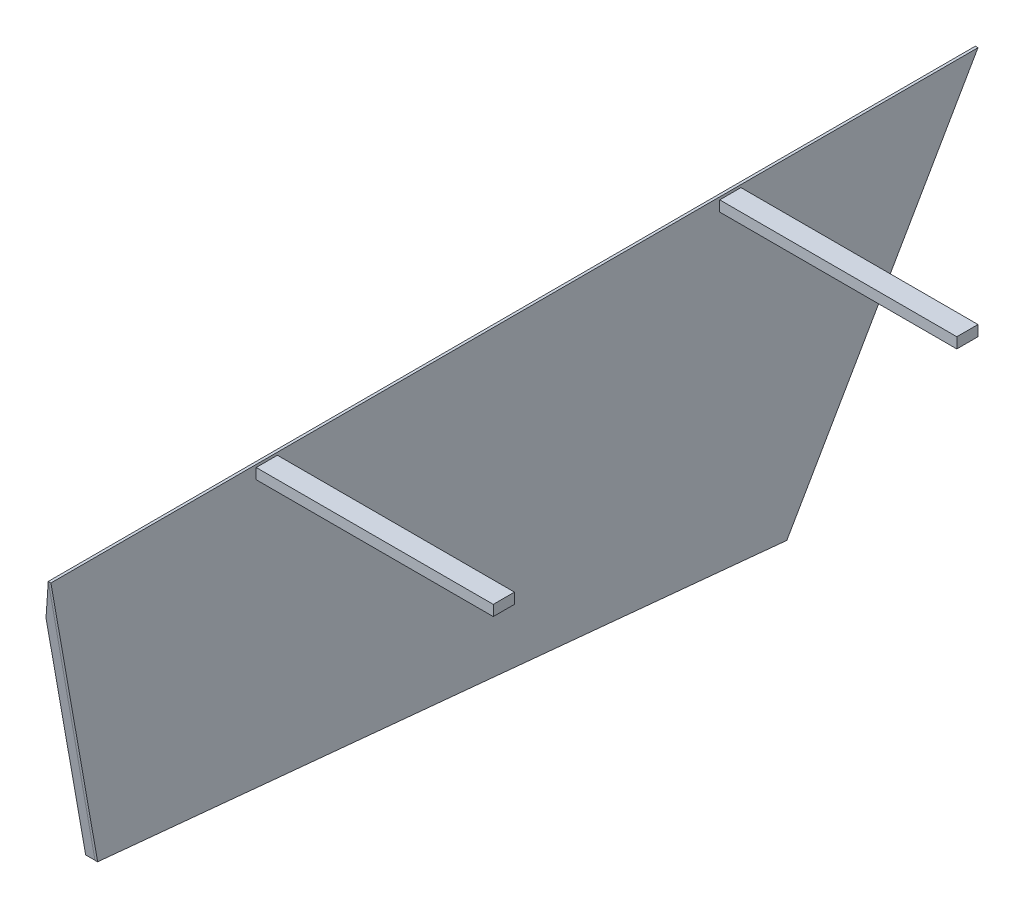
ISO-10303-21;
HEADER;
FILE_DESCRIPTION(('STEP AP214'),'2;1');
FILE_NAME('part.step','',(''),(''),'','','');
FILE_SCHEMA(('AUTOMOTIVE_DESIGN { 1 0 10303 214 1 1 1 1 }'));
ENDSEC;
DATA;
#1=APPLICATION_CONTEXT('core data for automotive mechanical design processes');
#2=APPLICATION_PROTOCOL_DEFINITION('international standard','automotive_design',2000,#1);
#3=PRODUCT_CONTEXT('',#1,'mechanical');
#4=PRODUCT('Part','Part','',(#3));
#5=PRODUCT_RELATED_PRODUCT_CATEGORY('part','',(#4));
#6=PRODUCT_DEFINITION_FORMATION('','',#4);
#7=PRODUCT_DEFINITION_CONTEXT('part definition',#1,'design');
#8=PRODUCT_DEFINITION('design','',#6,#7);
#9=PRODUCT_DEFINITION_SHAPE('','',#8);
#10=(LENGTH_UNIT() NAMED_UNIT(*) SI_UNIT(.MILLI.,.METRE.));
#11=(NAMED_UNIT(*) PLANE_ANGLE_UNIT() SI_UNIT($,.RADIAN.));
#12=(NAMED_UNIT(*) SI_UNIT($,.STERADIAN.) SOLID_ANGLE_UNIT());
#13=UNCERTAINTY_MEASURE_WITH_UNIT(LENGTH_MEASURE(1.E-05),#10,'distance_accuracy_value','');
#14=(GEOMETRIC_REPRESENTATION_CONTEXT(3) GLOBAL_UNCERTAINTY_ASSIGNED_CONTEXT((#13)) GLOBAL_UNIT_ASSIGNED_CONTEXT((#10,
#11,#12)) REPRESENTATION_CONTEXT('',''));
#15=CARTESIAN_POINT('',(0.,0.,0.));
#16=DIRECTION('',(0.,0.,1.));
#17=DIRECTION('',(1.,0.,0.));
#18=AXIS2_PLACEMENT_3D('',#15,#16,#17);
#19=CARTESIAN_POINT('',(-40.,-764.88660493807,1774.39655010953));
#20=DIRECTION('',(0.,-0.173648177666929,0.984807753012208));
#21=DIRECTION('',(0.,-0.984807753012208,-0.173648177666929));
#22=AXIS2_PLACEMENT_3D('',#19,#20,#21);
#23=PLANE('',#22);
#24=DIRECTION('',(0.,-0.984807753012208,-0.173648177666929));
#25=VECTOR('',#24,1.);
#26=CARTESIAN_POINT('',(-40.,-764.88660493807,1774.39655010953));
#27=LINE('',#26,#25);
#28=CARTESIAN_POINT('',(-40.,100.000000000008,1926.89939381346));
#29=VERTEX_POINT('',#28);
#30=CARTESIAN_POINT('',(-40.,-764.88660493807,1774.39655010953));
#31=VERTEX_POINT('',#30);
#32=EDGE_CURVE('E101',#29,#31,#27,.T.);
#33=ORIENTED_EDGE('',*,*,#32,.F.);
#34=DIRECTION('',(-0.223951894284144,-0.959793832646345,-0.169237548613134));
#35=VECTOR('',#34,1.);
#36=CARTESIAN_POINT('',(-113.031548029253,-212.992348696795,1871.7103979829));
#37=LINE('',#36,#35);
#38=CARTESIAN_POINT('',(-5.,250.00000000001,1953.34844091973));
#39=VERTEX_POINT('',#38);
#40=EDGE_CURVE('E62',#29,#39,#37,.F.);
#41=ORIENTED_EDGE('',*,*,#40,.T.);
#42=DIRECTION('',(0.,-0.984807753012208,-0.173648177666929));
#43=VECTOR('',#42,1.);
#44=CARTESIAN_POINT('',(-5.,-764.88660493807,1774.39655010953));
#45=LINE('',#44,#43);
#46=CARTESIAN_POINT('',(-5.,-764.88660493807,1774.39655010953));
#47=VERTEX_POINT('',#46);
#48=EDGE_CURVE('E106',#39,#47,#45,.T.);
#49=ORIENTED_EDGE('',*,*,#48,.T.);
#50=DIRECTION('',(1.,0.,0.));
#51=VECTOR('',#50,1.);
#52=CARTESIAN_POINT('',(-40.,-764.88660493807,1774.39655010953));
#53=LINE('',#52,#51);
#54=EDGE_CURVE('E121',#31,#47,#53,.T.);
#55=ORIENTED_EDGE('',*,*,#54,.F.);
#56=EDGE_LOOP('',(#33,#41,#49,#55));
#57=FACE_BOUND('',#56,.T.);
#58=ADVANCED_FACE('F53',(#57),#23,.F.);
#59=CARTESIAN_POINT('',(-40.,-749.99999999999,1929.33545199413));
#60=DIRECTION('',(0.,0.995415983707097,-0.0956400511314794));
#61=DIRECTION('',(0.,0.0956400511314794,0.995415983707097));
#62=AXIS2_PLACEMENT_3D('',#59,#60,#61);
#63=PLANE('',#62);
#64=DIRECTION('',(0.,0.0956400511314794,0.995415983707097));
#65=VECTOR('',#64,1.);
#66=CARTESIAN_POINT('',(-5.,-749.99999999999,1929.33545199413));
#67=LINE('',#66,#65);
#68=CARTESIAN_POINT('',(-5.,-749.99999999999,1929.33545199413));
#69=VERTEX_POINT('',#68);
#70=EDGE_CURVE('E100',#47,#69,#67,.T.);
#71=ORIENTED_EDGE('',*,*,#70,.T.);
#72=DIRECTION('',(1.,0.,0.));
#73=VECTOR('',#72,1.);
#74=CARTESIAN_POINT('',(-40.,-749.99999999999,1929.33545199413));
#75=LINE('',#74,#73);
#76=CARTESIAN_POINT('',(-40.,-749.99999999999,1929.33545199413));
#77=VERTEX_POINT('',#76);
#78=EDGE_CURVE('E97',#77,#69,#75,.T.);
#79=ORIENTED_EDGE('',*,*,#78,.F.);
#80=DIRECTION('',(0.,0.0956400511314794,0.995415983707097));
#81=VECTOR('',#80,1.);
#82=CARTESIAN_POINT('',(-40.,-749.99999999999,1929.33545199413));
#83=LINE('',#82,#81);
#84=EDGE_CURVE('E114',#31,#77,#83,.T.);
#85=ORIENTED_EDGE('',*,*,#84,.F.);
#86=ORIENTED_EDGE('',*,*,#54,.T.);
#87=EDGE_LOOP('',(#71,#79,#85,#86));
#88=FACE_BOUND('',#87,.T.);
#89=ADVANCED_FACE('F126',(#88),#63,.F.);
#90=CARTESIAN_POINT('',(-40.,250.00000000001,2105.66243270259));
#91=DIRECTION('',(0.,0.17364817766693,-0.984807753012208));
#92=DIRECTION('',(0.,0.984807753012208,0.17364817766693));
#93=AXIS2_PLACEMENT_3D('',#90,#91,#92);
#94=PLANE('',#93);
#95=DIRECTION('',(0.,0.984807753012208,0.17364817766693));
#96=VECTOR('',#95,1.);
#97=CARTESIAN_POINT('',(-5.,250.00000000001,2105.66243270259));
#98=LINE('',#97,#96);
#99=CARTESIAN_POINT('',(-5.,250.00000000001,2105.66243270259));
#100=VERTEX_POINT('',#99);
#101=EDGE_CURVE('E93',#69,#100,#98,.T.);
#102=ORIENTED_EDGE('',*,*,#101,.T.);
#103=DIRECTION('',(0.223951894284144,0.959793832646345,0.169237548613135));
#104=VECTOR('',#103,1.);
#105=CARTESIAN_POINT('',(-118.804411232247,-237.733190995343,2019.66191174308));
#106=LINE('',#105,#104);
#107=CARTESIAN_POINT('',(-40.,100.000000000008,2079.21338559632));
#108=VERTEX_POINT('',#107);
#109=EDGE_CURVE('E12',#100,#108,#106,.F.);
#110=ORIENTED_EDGE('',*,*,#109,.T.);
#111=DIRECTION('',(0.,0.984807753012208,0.17364817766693));
#112=VECTOR('',#111,1.);
#113=CARTESIAN_POINT('',(-40.,250.00000000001,2105.66243270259));
#114=LINE('',#113,#112);
#115=EDGE_CURVE('E116',#77,#108,#114,.T.);
#116=ORIENTED_EDGE('',*,*,#115,.F.);
#117=ORIENTED_EDGE('',*,*,#78,.T.);
#118=EDGE_LOOP('',(#102,#110,#116,#117));
#119=FACE_BOUND('',#118,.T.);
#120=ADVANCED_FACE('F95',(#119),#94,.F.);
#121=CARTESIAN_POINT('',(-40.,0.,0.));
#122=DIRECTION('',(1.,0.,0.));
#123=DIRECTION('',(0.,0.,-1.));
#124=AXIS2_PLACEMENT_3D('',#121,#122,#123);
#125=PLANE('',#124);
#126=ORIENTED_EDGE('',*,*,#115,.T.);
#127=DIRECTION('',(0.,0.,-1.));
#128=VECTOR('',#127,1.);
#129=CARTESIAN_POINT('',(-40.,100.000000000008,0.));
#130=LINE('',#129,#128);
#131=EDGE_CURVE('E107',#108,#29,#130,.T.);
#132=ORIENTED_EDGE('',*,*,#131,.T.);
#133=ORIENTED_EDGE('',*,*,#32,.T.);
#134=ORIENTED_EDGE('',*,*,#84,.T.);
#135=EDGE_LOOP('',(#126,#132,#133,#134));
#136=FACE_BOUND('',#135,.T.);
#137=ADVANCED_FACE('F128',(#136),#125,.F.);
#138=CARTESIAN_POINT('',(-5.,0.,0.));
#139=DIRECTION('',(1.,0.,0.));
#140=DIRECTION('',(0.,0.,-1.));
#141=AXIS2_PLACEMENT_3D('',#138,#139,#140);
#142=PLANE('',#141);
#143=DIRECTION('',(0.,0.,-1.));
#144=VECTOR('',#143,1.);
#145=CARTESIAN_POINT('',(-5.,250.00000000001,1953.34844091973));
#146=LINE('',#145,#144);
#147=EDGE_CURVE('E104',#100,#39,#146,.T.);
#148=ORIENTED_EDGE('',*,*,#147,.F.);
#149=ORIENTED_EDGE('',*,*,#101,.F.);
#150=ORIENTED_EDGE('',*,*,#70,.F.);
#151=ORIENTED_EDGE('',*,*,#48,.F.);
#152=EDGE_LOOP('',(#148,#149,#150,#151));
#153=FACE_BOUND('',#152,.T.);
#154=ADVANCED_FACE('F105',(#153),#142,.T.);
#155=CARTESIAN_POINT('',(-40.,100.000000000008,0.));
#156=DIRECTION('',(0.973841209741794,-0.227229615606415,0.));
#157=DIRECTION('',(0.,0.,-1.));
#158=AXIS2_PLACEMENT_3D('',#155,#156,#157);
#159=PLANE('',#158);
#160=ORIENTED_EDGE('',*,*,#109,.F.);
#161=ORIENTED_EDGE('',*,*,#147,.T.);
#162=ORIENTED_EDGE('',*,*,#40,.F.);
#163=ORIENTED_EDGE('',*,*,#131,.F.);
#164=EDGE_LOOP('',(#160,#161,#162,#163));
#165=FACE_BOUND('',#164,.T.);
#166=ADVANCED_FACE('F56',(#165),#159,.F.);
#167=CLOSED_SHELL('',(#58,#89,#120,#137,#154,#166));
#168=MANIFOLD_SOLID_BREP('B2',#167);
#169=CARTESIAN_POINT('',(-40.,250.00000000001,-1394.33756729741));
#170=DIRECTION('',(0.,0.500000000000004,0.866025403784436));
#171=DIRECTION('',(0.,-0.866025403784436,0.500000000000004));
#172=AXIS2_PLACEMENT_3D('',#169,#170,#171);
#173=PLANE('',#172);
#174=DIRECTION('',(0.,-0.866025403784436,0.500000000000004));
#175=VECTOR('',#174,1.);
#176=CARTESIAN_POINT('',(-40.,250.00000000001,-1394.33756729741));
#177=LINE('',#176,#175);
#178=CARTESIAN_POINT('',(-40.,100.000000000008,-1307.73502691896));
#179=VERTEX_POINT('',#178);
#180=CARTESIAN_POINT('',(-40.,-999.99999999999,-672.649730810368));
#181=VERTEX_POINT('',#180);
#182=EDGE_CURVE('E240',#179,#181,#177,.T.);
#183=ORIENTED_EDGE('',*,*,#182,.F.);
#184=DIRECTION('',(0.198069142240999,0.848867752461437,-0.490094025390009));
#185=VECTOR('',#184,1.);
#186=CARTESIAN_POINT('',(-166.945112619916,-444.050482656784,-993.627334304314));
#187=LINE('',#186,#185);
#188=CARTESIAN_POINT('',(-5.,250.00000000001,-1394.33756729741));
#189=VERTEX_POINT('',#188);
#190=EDGE_CURVE('E209',#179,#189,#187,.T.);
#191=ORIENTED_EDGE('',*,*,#190,.T.);
#192=DIRECTION('',(0.,-0.866025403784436,0.500000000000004));
#193=VECTOR('',#192,1.);
#194=CARTESIAN_POINT('',(-5.,250.00000000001,-1394.33756729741));
#195=LINE('',#194,#193);
#196=CARTESIAN_POINT('',(-5.,-999.99999999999,-672.649730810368));
#197=VERTEX_POINT('',#196);
#198=EDGE_CURVE('E253',#189,#197,#195,.T.);
#199=ORIENTED_EDGE('',*,*,#198,.T.);
#200=DIRECTION('',(1.,0.,0.));
#201=VECTOR('',#200,1.);
#202=CARTESIAN_POINT('',(-40.,-999.99999999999,-672.649730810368));
#203=LINE('',#202,#201);
#204=EDGE_CURVE('E251',#181,#197,#203,.T.);
#205=ORIENTED_EDGE('',*,*,#204,.F.);
#206=EDGE_LOOP('',(#183,#191,#199,#205));
#207=FACE_BOUND('',#206,.T.);
#208=ADVANCED_FACE('F200',(#207),#173,.F.);
#209=CARTESIAN_POINT('',(-40.,-999.99999999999,-672.649730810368));
#210=DIRECTION('',(0.,0.995415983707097,-0.0956400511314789));
#211=DIRECTION('',(0.,0.0956400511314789,0.995415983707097));
#212=AXIS2_PLACEMENT_3D('',#209,#210,#211);
#213=PLANE('',#212);
#214=DIRECTION('',(0.,0.0956400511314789,0.995415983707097));
#215=VECTOR('',#214,1.);
#216=CARTESIAN_POINT('',(-5.,-999.99999999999,-672.649730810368));
#217=LINE('',#216,#215);
#218=CARTESIAN_POINT('',(-5.,-984.233000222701,-508.547731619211));
#219=VERTEX_POINT('',#218);
#220=EDGE_CURVE('E267',#197,#219,#217,.T.);
#221=ORIENTED_EDGE('',*,*,#220,.T.);
#222=DIRECTION('',(1.,0.,0.));
#223=VECTOR('',#222,1.);
#224=CARTESIAN_POINT('',(-40.,-984.233000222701,-508.547731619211));
#225=LINE('',#224,#223);
#226=CARTESIAN_POINT('',(-40.,-984.233000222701,-508.547731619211));
#227=VERTEX_POINT('',#226);
#228=EDGE_CURVE('E256',#227,#219,#225,.T.);
#229=ORIENTED_EDGE('',*,*,#228,.F.);
#230=DIRECTION('',(0.,0.0956400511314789,0.995415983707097));
#231=VECTOR('',#230,1.);
#232=CARTESIAN_POINT('',(-40.,-999.99999999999,-672.649730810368));
#233=LINE('',#232,#231);
#234=EDGE_CURVE('E244',#181,#227,#233,.T.);
#235=ORIENTED_EDGE('',*,*,#234,.F.);
#236=ORIENTED_EDGE('',*,*,#204,.T.);
#237=EDGE_LOOP('',(#221,#229,#235,#236));
#238=FACE_BOUND('',#237,.T.);
#239=ADVANCED_FACE('F258',(#238),#213,.F.);
#240=CARTESIAN_POINT('',(-40.,-984.233000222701,-508.547731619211));
#241=DIRECTION('',(0.,-0.500000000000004,-0.866025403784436));
#242=DIRECTION('',(0.,0.866025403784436,-0.500000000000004));
#243=AXIS2_PLACEMENT_3D('',#240,#241,#242);
#244=PLANE('',#243);
#245=DIRECTION('',(0.,0.866025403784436,-0.500000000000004));
#246=VECTOR('',#245,1.);
#247=CARTESIAN_POINT('',(-5.,-984.233000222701,-508.547731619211));
#248=LINE('',#247,#246);
#249=CARTESIAN_POINT('',(-5.,250.00000000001,-1221.13248654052));
#250=VERTEX_POINT('',#249);
#251=EDGE_CURVE('E248',#219,#250,#248,.T.);
#252=ORIENTED_EDGE('',*,*,#251,.T.);
#253=DIRECTION('',(-0.198069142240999,-0.848867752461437,0.490094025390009));
#254=VECTOR('',#253,1.);
#255=CARTESIAN_POINT('',(-150.131661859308,-371.99283653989,-862.024754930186));
#256=LINE('',#255,#254);
#257=CARTESIAN_POINT('',(-40.,100.000000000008,-1134.52994616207));
#258=VERTEX_POINT('',#257);
#259=EDGE_CURVE('E51',#250,#258,#256,.T.);
#260=ORIENTED_EDGE('',*,*,#259,.T.);
#261=DIRECTION('',(0.,0.866025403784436,-0.500000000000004));
#262=VECTOR('',#261,1.);
#263=CARTESIAN_POINT('',(-40.,-984.233000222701,-508.547731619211));
#264=LINE('',#263,#262);
#265=EDGE_CURVE('E260',#227,#258,#264,.T.);
#266=ORIENTED_EDGE('',*,*,#265,.F.);
#267=ORIENTED_EDGE('',*,*,#228,.T.);
#268=EDGE_LOOP('',(#252,#260,#266,#267));
#269=FACE_BOUND('',#268,.T.);
#270=ADVANCED_FACE('F284',(#269),#244,.F.);
#271=CARTESIAN_POINT('',(-40.,0.,0.));
#272=DIRECTION('',(-1.,0.,0.));
#273=DIRECTION('',(0.,0.,1.));
#274=AXIS2_PLACEMENT_3D('',#271,#272,#273);
#275=PLANE('',#274);
#276=ORIENTED_EDGE('',*,*,#265,.T.);
#277=DIRECTION('',(0.,0.,-1.));
#278=VECTOR('',#277,1.);
#279=CARTESIAN_POINT('',(-40.,100.000000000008,-1394.33756729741));
#280=LINE('',#279,#278);
#281=EDGE_CURVE('E246',#258,#179,#280,.T.);
#282=ORIENTED_EDGE('',*,*,#281,.T.);
#283=ORIENTED_EDGE('',*,*,#182,.T.);
#284=ORIENTED_EDGE('',*,*,#234,.T.);
#285=EDGE_LOOP('',(#276,#282,#283,#284));
#286=FACE_BOUND('',#285,.T.);
#287=ADVANCED_FACE('F242',(#286),#275,.T.);
#288=CARTESIAN_POINT('',(-5.,0.,0.));
#289=DIRECTION('',(-1.,0.,0.));
#290=DIRECTION('',(0.,0.,1.));
#291=AXIS2_PLACEMENT_3D('',#288,#289,#290);
#292=PLANE('',#291);
#293=DIRECTION('',(0.,0.,-1.));
#294=VECTOR('',#293,1.);
#295=CARTESIAN_POINT('',(-5.,250.00000000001,-1221.13248654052));
#296=LINE('',#295,#294);
#297=EDGE_CURVE('E264',#250,#189,#296,.T.);
#298=ORIENTED_EDGE('',*,*,#297,.F.);
#299=ORIENTED_EDGE('',*,*,#251,.F.);
#300=ORIENTED_EDGE('',*,*,#220,.F.);
#301=ORIENTED_EDGE('',*,*,#198,.F.);
#302=EDGE_LOOP('',(#298,#299,#300,#301));
#303=FACE_BOUND('',#302,.T.);
#304=ADVANCED_FACE('F273',(#303),#292,.F.);
#305=CARTESIAN_POINT('',(-40.,100.000000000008,0.));
#306=DIRECTION('',(-0.973841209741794,0.227229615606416,0.));
#307=DIRECTION('',(0.,0.,1.));
#308=AXIS2_PLACEMENT_3D('',#305,#306,#307);
#309=PLANE('',#308);
#310=ORIENTED_EDGE('',*,*,#259,.F.);
#311=ORIENTED_EDGE('',*,*,#297,.T.);
#312=ORIENTED_EDGE('',*,*,#190,.F.);
#313=ORIENTED_EDGE('',*,*,#281,.F.);
#314=EDGE_LOOP('',(#310,#311,#312,#313));
#315=FACE_BOUND('',#314,.T.);
#316=ADVANCED_FACE('F203',(#315),#309,.T.);
#317=CLOSED_SHELL('',(#208,#239,#270,#287,#304,#316));
#318=MANIFOLD_SOLID_BREP('B6',#317);
#319=CARTESIAN_POINT('',(5.,0.,0.));
#320=DIRECTION('',(1.,0.,0.));
#321=DIRECTION('',(0.,0.,-1.));
#322=AXIS2_PLACEMENT_3D('',#319,#320,#321);
#323=PLANE('',#322);
#324=DIRECTION('',(0.,-0.984807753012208,-0.173648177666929));
#325=VECTOR('',#324,1.);
#326=CARTESIAN_POINT('',(5.,250.00000000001,2105.66243270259));
#327=LINE('',#326,#325);
#328=CARTESIAN_POINT('',(5.,250.00000000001,2105.66243270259));
#329=VERTEX_POINT('',#328);
#330=CARTESIAN_POINT('',(5.,-749.99999999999,1929.33545199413));
#331=VERTEX_POINT('',#330);
#332=EDGE_CURVE('E472',#329,#331,#327,.T.);
#333=ORIENTED_EDGE('',*,*,#332,.T.);
#334=DIRECTION('',(0.,-0.0956400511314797,-0.995415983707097));
#335=VECTOR('',#334,1.);
#336=CARTESIAN_POINT('',(5.,-749.99999999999,1929.33545199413));
#337=LINE('',#336,#335);
#338=CARTESIAN_POINT('',(5.,-999.99999999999,-672.649730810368));
#339=VERTEX_POINT('',#338);
#340=EDGE_CURVE('E475',#331,#339,#337,.T.);
#341=ORIENTED_EDGE('',*,*,#340,.T.);
#342=DIRECTION('',(0.,0.866025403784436,-0.500000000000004));
#343=VECTOR('',#342,1.);
#344=CARTESIAN_POINT('',(5.,-999.99999999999,-672.649730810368));
#345=LINE('',#344,#343);
#346=CARTESIAN_POINT('',(5.,250.00000000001,-1394.33756729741));
#347=VERTEX_POINT('',#346);
#348=EDGE_CURVE('E478',#339,#347,#345,.T.);
#349=ORIENTED_EDGE('',*,*,#348,.T.);
#350=DIRECTION('',(0.,0.,1.));
#351=VECTOR('',#350,1.);
#352=CARTESIAN_POINT('',(5.,250.00000000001,2105.66243270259));
#353=LINE('',#352,#351);
#354=EDGE_CURVE('E480',#347,#329,#353,.T.);
#355=ORIENTED_EDGE('',*,*,#354,.T.);
#356=EDGE_LOOP('',(#333,#341,#349,#355));
#357=FACE_BOUND('',#356,.T.);
#358=DIRECTION('',(0.,0.,-1.));
#359=VECTOR('',#358,1.);
#360=CARTESIAN_POINT('',(5.,240.00000000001,0.));
#361=LINE('',#360,#359);
#362=CARTESIAN_POINT('',(5.,240.00000000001,-419.337567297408));
#363=VERTEX_POINT('',#362);
#364=CARTESIAN_POINT('',(5.,240.00000000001,-499.337567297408));
#365=VERTEX_POINT('',#364);
#366=EDGE_CURVE('E508',#363,#365,#361,.T.);
#367=ORIENTED_EDGE('',*,*,#366,.T.);
#368=DIRECTION('',(0.,-1.,0.));
#369=VECTOR('',#368,1.);
#370=CARTESIAN_POINT('',(5.,0.,-499.337567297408));
#371=LINE('',#370,#369);
#372=CARTESIAN_POINT('',(5.,200.00000000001,-499.337567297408));
#373=VERTEX_POINT('',#372);
#374=EDGE_CURVE('E511',#365,#373,#371,.T.);
#375=ORIENTED_EDGE('',*,*,#374,.T.);
#376=DIRECTION('',(0.,0.,1.));
#377=VECTOR('',#376,1.);
#378=CARTESIAN_POINT('',(5.,200.00000000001,0.));
#379=LINE('',#378,#377);
#380=CARTESIAN_POINT('',(5.,200.00000000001,-419.337567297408));
#381=VERTEX_POINT('',#380);
#382=EDGE_CURVE('E502',#373,#381,#379,.T.);
#383=ORIENTED_EDGE('',*,*,#382,.T.);
#384=DIRECTION('',(0.,1.,0.));
#385=VECTOR('',#384,1.);
#386=CARTESIAN_POINT('',(5.,0.,-419.337567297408));
#387=LINE('',#386,#385);
#388=EDGE_CURVE('E505',#381,#363,#387,.T.);
#389=ORIENTED_EDGE('',*,*,#388,.T.);
#390=EDGE_LOOP('',(#367,#375,#383,#389));
#391=FACE_BOUND('',#390,.T.);
#392=DIRECTION('',(0.,0.,-1.));
#393=VECTOR('',#392,1.);
#394=CARTESIAN_POINT('',(5.,240.00000000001,0.));
#395=LINE('',#394,#393);
#396=CARTESIAN_POINT('',(5.,240.00000000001,1330.66243270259));
#397=VERTEX_POINT('',#396);
#398=CARTESIAN_POINT('',(5.,240.00000000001,1250.66243270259));
#399=VERTEX_POINT('',#398);
#400=EDGE_CURVE('E346',#397,#399,#395,.T.);
#401=ORIENTED_EDGE('',*,*,#400,.T.);
#402=DIRECTION('',(0.,-1.,0.));
#403=VECTOR('',#402,1.);
#404=CARTESIAN_POINT('',(5.,0.,1250.66243270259));
#405=LINE('',#404,#403);
#406=CARTESIAN_POINT('',(5.,200.00000000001,1250.66243270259));
#407=VERTEX_POINT('',#406);
#408=EDGE_CURVE('E198',#399,#407,#405,.T.);
#409=ORIENTED_EDGE('',*,*,#408,.T.);
#410=DIRECTION('',(0.,0.,1.));
#411=VECTOR('',#410,1.);
#412=CARTESIAN_POINT('',(5.,200.00000000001,0.));
#413=LINE('',#412,#411);
#414=CARTESIAN_POINT('',(5.,200.00000000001,1330.66243270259));
#415=VERTEX_POINT('',#414);
#416=EDGE_CURVE('E441',#407,#415,#413,.T.);
#417=ORIENTED_EDGE('',*,*,#416,.T.);
#418=DIRECTION('',(0.,1.,0.));
#419=VECTOR('',#418,1.);
#420=CARTESIAN_POINT('',(5.,0.,1330.66243270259));
#421=LINE('',#420,#419);
#422=EDGE_CURVE('E515',#415,#397,#421,.T.);
#423=ORIENTED_EDGE('',*,*,#422,.T.);
#424=EDGE_LOOP('',(#401,#409,#417,#423));
#425=FACE_BOUND('',#424,.T.);
#426=ADVANCED_FACE('F338',(#357,#391,#425),#323,.T.);
#427=CARTESIAN_POINT('',(5.,250.00000000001,2105.66243270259));
#428=DIRECTION('',(0.,0.173648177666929,-0.984807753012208));
#429=DIRECTION('',(0.,0.984807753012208,0.173648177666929));
#430=AXIS2_PLACEMENT_3D('',#427,#428,#429);
#431=PLANE('',#430);
#432=DIRECTION('',(0.,-0.984807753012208,-0.173648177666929));
#433=VECTOR('',#432,1.);
#434=CARTESIAN_POINT('',(-5.,250.00000000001,2105.66243270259));
#435=LINE('',#434,#433);
#436=CARTESIAN_POINT('',(-5.,250.00000000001,2105.66243270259));
#437=VERTEX_POINT('',#436);
#438=CARTESIAN_POINT('',(-5.,-749.99999999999,1929.33545199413));
#439=VERTEX_POINT('',#438);
#440=EDGE_CURVE('E471',#437,#439,#435,.T.);
#441=ORIENTED_EDGE('',*,*,#440,.T.);
#442=DIRECTION('',(-1.,0.,0.));
#443=VECTOR('',#442,1.);
#444=CARTESIAN_POINT('',(5.,-749.99999999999,1929.33545199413));
#445=LINE('',#444,#443);
#446=EDGE_CURVE('E499',#331,#439,#445,.T.);
#447=ORIENTED_EDGE('',*,*,#446,.F.);
#448=ORIENTED_EDGE('',*,*,#332,.F.);
#449=DIRECTION('',(-1.,0.,0.));
#450=VECTOR('',#449,1.);
#451=CARTESIAN_POINT('',(5.,250.00000000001,2105.66243270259));
#452=LINE('',#451,#450);
#453=EDGE_CURVE('E482',#329,#437,#452,.T.);
#454=ORIENTED_EDGE('',*,*,#453,.T.);
#455=EDGE_LOOP('',(#441,#447,#448,#454));
#456=FACE_BOUND('',#455,.T.);
#457=ADVANCED_FACE('F340',(#456),#431,.F.);
#458=CARTESIAN_POINT('',(5.,-749.99999999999,1929.33545199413));
#459=DIRECTION('',(0.,0.995415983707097,-0.0956400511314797));
#460=DIRECTION('',(0.,0.0956400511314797,0.995415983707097));
#461=AXIS2_PLACEMENT_3D('',#458,#459,#460);
#462=PLANE('',#461);
#463=DIRECTION('',(0.,-0.0956400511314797,-0.995415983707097));
#464=VECTOR('',#463,1.);
#465=CARTESIAN_POINT('',(-5.,-749.99999999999,1929.33545199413));
#466=LINE('',#465,#464);
#467=CARTESIAN_POINT('',(-5.,-999.99999999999,-672.649730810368));
#468=VERTEX_POINT('',#467);
#469=EDGE_CURVE('E485',#439,#468,#466,.T.);
#470=ORIENTED_EDGE('',*,*,#469,.T.);
#471=DIRECTION('',(-1.,0.,0.));
#472=VECTOR('',#471,1.);
#473=CARTESIAN_POINT('',(5.,-999.99999999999,-672.649730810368));
#474=LINE('',#473,#472);
#475=EDGE_CURVE('E496',#339,#468,#474,.T.);
#476=ORIENTED_EDGE('',*,*,#475,.F.);
#477=ORIENTED_EDGE('',*,*,#340,.F.);
#478=ORIENTED_EDGE('',*,*,#446,.T.);
#479=EDGE_LOOP('',(#470,#476,#477,#478));
#480=FACE_BOUND('',#479,.T.);
#481=ADVANCED_FACE('F543',(#480),#462,.F.);
#482=CARTESIAN_POINT('',(5.,250.00000000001,-1394.33756729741));
#483=DIRECTION('',(0.,0.500000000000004,0.866025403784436));
#484=DIRECTION('',(0.,-0.866025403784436,0.500000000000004));
#485=AXIS2_PLACEMENT_3D('',#482,#483,#484);
#486=PLANE('',#485);
#487=DIRECTION('',(0.,0.866025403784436,-0.500000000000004));
#488=VECTOR('',#487,1.);
#489=CARTESIAN_POINT('',(-5.,250.00000000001,-1394.33756729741));
#490=LINE('',#489,#488);
#491=CARTESIAN_POINT('',(-5.,250.00000000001,-1394.33756729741));
#492=VERTEX_POINT('',#491);
#493=EDGE_CURVE('E488',#468,#492,#490,.T.);
#494=ORIENTED_EDGE('',*,*,#493,.T.);
#495=DIRECTION('',(-1.,0.,0.));
#496=VECTOR('',#495,1.);
#497=CARTESIAN_POINT('',(5.,250.00000000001,-1394.33756729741));
#498=LINE('',#497,#496);
#499=EDGE_CURVE('E493',#347,#492,#498,.T.);
#500=ORIENTED_EDGE('',*,*,#499,.F.);
#501=ORIENTED_EDGE('',*,*,#348,.F.);
#502=ORIENTED_EDGE('',*,*,#475,.T.);
#503=EDGE_LOOP('',(#494,#500,#501,#502));
#504=FACE_BOUND('',#503,.T.);
#505=ADVANCED_FACE('F557',(#504),#486,.F.);
#506=CARTESIAN_POINT('',(5.,250.00000000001,2105.66243270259));
#507=DIRECTION('',(0.,-1.,0.));
#508=DIRECTION('',(0.,0.,-1.));
#509=AXIS2_PLACEMENT_3D('',#506,#507,#508);
#510=PLANE('',#509);
#511=DIRECTION('',(0.,0.,1.));
#512=VECTOR('',#511,1.);
#513=CARTESIAN_POINT('',(-5.,250.00000000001,2105.66243270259));
#514=LINE('',#513,#512);
#515=EDGE_CURVE('E476',#492,#437,#514,.T.);
#516=ORIENTED_EDGE('',*,*,#515,.T.);
#517=ORIENTED_EDGE('',*,*,#453,.F.);
#518=ORIENTED_EDGE('',*,*,#354,.F.);
#519=ORIENTED_EDGE('',*,*,#499,.T.);
#520=EDGE_LOOP('',(#516,#517,#518,#519));
#521=FACE_BOUND('',#520,.T.);
#522=ADVANCED_FACE('F553',(#521),#510,.F.);
#523=CARTESIAN_POINT('',(-5.,0.,0.));
#524=DIRECTION('',(1.,0.,0.));
#525=DIRECTION('',(0.,0.,-1.));
#526=AXIS2_PLACEMENT_3D('',#523,#524,#525);
#527=PLANE('',#526);
#528=ORIENTED_EDGE('',*,*,#440,.F.);
#529=ORIENTED_EDGE('',*,*,#515,.F.);
#530=ORIENTED_EDGE('',*,*,#493,.F.);
#531=ORIENTED_EDGE('',*,*,#469,.F.);
#532=EDGE_LOOP('',(#528,#529,#530,#531));
#533=FACE_BOUND('',#532,.T.);
#534=ADVANCED_FACE('F550',(#533),#527,.F.);
#535=CARTESIAN_POINT('',(900.,200.00000000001,-499.337567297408));
#536=DIRECTION('',(0.,0.,1.));
#537=DIRECTION('',(1.,0.,0.));
#538=AXIS2_PLACEMENT_3D('',#535,#536,#537);
#539=PLANE('',#538);
#540=ORIENTED_EDGE('',*,*,#374,.F.);
#541=DIRECTION('',(-1.,0.,0.));
#542=VECTOR('',#541,1.);
#543=CARTESIAN_POINT('',(900.,240.00000000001,-499.337567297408));
#544=LINE('',#543,#542);
#545=CARTESIAN_POINT('',(900.,240.00000000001,-499.337567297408));
#546=VERTEX_POINT('',#545);
#547=EDGE_CURVE('E468',#546,#365,#544,.T.);
#548=ORIENTED_EDGE('',*,*,#547,.F.);
#549=DIRECTION('',(0.,1.,0.));
#550=VECTOR('',#549,1.);
#551=CARTESIAN_POINT('',(900.,200.00000000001,-499.337567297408));
#552=LINE('',#551,#550);
#553=CARTESIAN_POINT('',(900.,200.00000000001,-499.337567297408));
#554=VERTEX_POINT('',#553);
#555=EDGE_CURVE('E447',#554,#546,#552,.T.);
#556=ORIENTED_EDGE('',*,*,#555,.F.);
#557=DIRECTION('',(-1.,0.,0.));
#558=VECTOR('',#557,1.);
#559=CARTESIAN_POINT('',(900.,200.00000000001,-499.337567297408));
#560=LINE('',#559,#558);
#561=EDGE_CURVE('E461',#554,#373,#560,.T.);
#562=ORIENTED_EDGE('',*,*,#561,.T.);
#563=EDGE_LOOP('',(#540,#548,#556,#562));
#564=FACE_BOUND('',#563,.T.);
#565=ADVANCED_FACE('F548',(#564),#539,.F.);
#566=CARTESIAN_POINT('',(900.,240.00000000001,-419.337567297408));
#567=DIRECTION('',(0.,-1.,0.));
#568=DIRECTION('',(0.,0.,-1.));
#569=AXIS2_PLACEMENT_3D('',#566,#567,#568);
#570=PLANE('',#569);
#571=ORIENTED_EDGE('',*,*,#366,.F.);
#572=DIRECTION('',(-1.,0.,0.));
#573=VECTOR('',#572,1.);
#574=CARTESIAN_POINT('',(900.,240.00000000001,-419.337567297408));
#575=LINE('',#574,#573);
#576=CARTESIAN_POINT('',(900.,240.00000000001,-419.337567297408));
#577=VERTEX_POINT('',#576);
#578=EDGE_CURVE('E465',#577,#363,#575,.T.);
#579=ORIENTED_EDGE('',*,*,#578,.F.);
#580=DIRECTION('',(0.,0.,1.));
#581=VECTOR('',#580,1.);
#582=CARTESIAN_POINT('',(900.,240.00000000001,-419.337567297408));
#583=LINE('',#582,#581);
#584=EDGE_CURVE('E451',#546,#577,#583,.T.);
#585=ORIENTED_EDGE('',*,*,#584,.F.);
#586=ORIENTED_EDGE('',*,*,#547,.T.);
#587=EDGE_LOOP('',(#571,#579,#585,#586));
#588=FACE_BOUND('',#587,.T.);
#589=ADVANCED_FACE('F594',(#588),#570,.F.);
#590=CARTESIAN_POINT('',(900.,200.00000000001,-419.337567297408));
#591=DIRECTION('',(0.,0.,-1.));
#592=DIRECTION('',(-1.,0.,0.));
#593=AXIS2_PLACEMENT_3D('',#590,#591,#592);
#594=PLANE('',#593);
#595=ORIENTED_EDGE('',*,*,#388,.F.);
#596=DIRECTION('',(-1.,0.,0.));
#597=VECTOR('',#596,1.);
#598=CARTESIAN_POINT('',(900.,200.00000000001,-419.337567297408));
#599=LINE('',#598,#597);
#600=CARTESIAN_POINT('',(900.,200.00000000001,-419.337567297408));
#601=VERTEX_POINT('',#600);
#602=EDGE_CURVE('E361',#601,#381,#599,.T.);
#603=ORIENTED_EDGE('',*,*,#602,.F.);
#604=DIRECTION('',(0.,-1.,0.));
#605=VECTOR('',#604,1.);
#606=CARTESIAN_POINT('',(900.,200.00000000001,-419.337567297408));
#607=LINE('',#606,#605);
#608=EDGE_CURVE('E457',#577,#601,#607,.T.);
#609=ORIENTED_EDGE('',*,*,#608,.F.);
#610=ORIENTED_EDGE('',*,*,#578,.T.);
#611=EDGE_LOOP('',(#595,#603,#609,#610));
#612=FACE_BOUND('',#611,.T.);
#613=ADVANCED_FACE('F601',(#612),#594,.F.);
#614=CARTESIAN_POINT('',(900.,200.00000000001,-419.337567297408));
#615=DIRECTION('',(0.,1.,0.));
#616=DIRECTION('',(0.,0.,1.));
#617=AXIS2_PLACEMENT_3D('',#614,#615,#616);
#618=PLANE('',#617);
#619=ORIENTED_EDGE('',*,*,#382,.F.);
#620=ORIENTED_EDGE('',*,*,#561,.F.);
#621=DIRECTION('',(0.,0.,-1.));
#622=VECTOR('',#621,1.);
#623=CARTESIAN_POINT('',(900.,200.00000000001,-419.337567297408));
#624=LINE('',#623,#622);
#625=EDGE_CURVE('E459',#601,#554,#624,.T.);
#626=ORIENTED_EDGE('',*,*,#625,.F.);
#627=ORIENTED_EDGE('',*,*,#602,.T.);
#628=EDGE_LOOP('',(#619,#620,#626,#627));
#629=FACE_BOUND('',#628,.T.);
#630=ADVANCED_FACE('F608',(#629),#618,.F.);
#631=CARTESIAN_POINT('',(900.,0.,0.));
#632=DIRECTION('',(-1.,0.,0.));
#633=DIRECTION('',(0.,0.,1.));
#634=AXIS2_PLACEMENT_3D('',#631,#632,#633);
#635=PLANE('',#634);
#636=ORIENTED_EDGE('',*,*,#555,.T.);
#637=ORIENTED_EDGE('',*,*,#584,.T.);
#638=ORIENTED_EDGE('',*,*,#608,.T.);
#639=ORIENTED_EDGE('',*,*,#625,.T.);
#640=EDGE_LOOP('',(#636,#637,#638,#639));
#641=FACE_BOUND('',#640,.T.);
#642=ADVANCED_FACE('F616',(#641),#635,.F.);
#643=CARTESIAN_POINT('',(900.,200.00000000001,1250.66243270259));
#644=DIRECTION('',(0.,0.,1.));
#645=DIRECTION('',(1.,0.,0.));
#646=AXIS2_PLACEMENT_3D('',#643,#644,#645);
#647=PLANE('',#646);
#648=ORIENTED_EDGE('',*,*,#408,.F.);
#649=DIRECTION('',(-1.,0.,0.));
#650=VECTOR('',#649,1.);
#651=CARTESIAN_POINT('',(900.,240.00000000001,1250.66243270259));
#652=LINE('',#651,#650);
#653=CARTESIAN_POINT('',(900.,240.00000000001,1250.66243270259));
#654=VERTEX_POINT('',#653);
#655=EDGE_CURVE('E446',#654,#399,#652,.T.);
#656=ORIENTED_EDGE('',*,*,#655,.F.);
#657=DIRECTION('',(0.,1.,0.));
#658=VECTOR('',#657,1.);
#659=CARTESIAN_POINT('',(900.,200.00000000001,1250.66243270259));
#660=LINE('',#659,#658);
#661=CARTESIAN_POINT('',(900.,200.00000000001,1250.66243270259));
#662=VERTEX_POINT('',#661);
#663=EDGE_CURVE('E432',#662,#654,#660,.T.);
#664=ORIENTED_EDGE('',*,*,#663,.F.);
#665=DIRECTION('',(-1.,0.,0.));
#666=VECTOR('',#665,1.);
#667=CARTESIAN_POINT('',(900.,200.00000000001,1250.66243270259));
#668=LINE('',#667,#666);
#669=EDGE_CURVE('E436',#662,#407,#668,.T.);
#670=ORIENTED_EDGE('',*,*,#669,.T.);
#671=EDGE_LOOP('',(#648,#656,#664,#670));
#672=FACE_BOUND('',#671,.T.);
#673=ADVANCED_FACE('F444',(#672),#647,.F.);
#674=CARTESIAN_POINT('',(900.,240.00000000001,1330.66243270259));
#675=DIRECTION('',(0.,-1.,0.));
#676=DIRECTION('',(0.,0.,-1.));
#677=AXIS2_PLACEMENT_3D('',#674,#675,#676);
#678=PLANE('',#677);
#679=ORIENTED_EDGE('',*,*,#400,.F.);
#680=DIRECTION('',(-1.,0.,0.));
#681=VECTOR('',#680,1.);
#682=CARTESIAN_POINT('',(900.,240.00000000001,1330.66243270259));
#683=LINE('',#682,#681);
#684=CARTESIAN_POINT('',(900.,240.00000000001,1330.66243270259));
#685=VERTEX_POINT('',#684);
#686=EDGE_CURVE('E523',#685,#397,#683,.T.);
#687=ORIENTED_EDGE('',*,*,#686,.F.);
#688=DIRECTION('',(0.,0.,1.));
#689=VECTOR('',#688,1.);
#690=CARTESIAN_POINT('',(900.,240.00000000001,1330.66243270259));
#691=LINE('',#690,#689);
#692=EDGE_CURVE('E448',#654,#685,#691,.T.);
#693=ORIENTED_EDGE('',*,*,#692,.F.);
#694=ORIENTED_EDGE('',*,*,#655,.T.);
#695=EDGE_LOOP('',(#679,#687,#693,#694));
#696=FACE_BOUND('',#695,.T.);
#697=ADVANCED_FACE('F522',(#696),#678,.F.);
#698=CARTESIAN_POINT('',(900.,200.00000000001,1330.66243270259));
#699=DIRECTION('',(0.,0.,-1.));
#700=DIRECTION('',(-1.,0.,0.));
#701=AXIS2_PLACEMENT_3D('',#698,#699,#700);
#702=PLANE('',#701);
#703=ORIENTED_EDGE('',*,*,#422,.F.);
#704=DIRECTION('',(-1.,0.,0.));
#705=VECTOR('',#704,1.);
#706=CARTESIAN_POINT('',(900.,200.00000000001,1330.66243270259));
#707=LINE('',#706,#705);
#708=CARTESIAN_POINT('',(900.,200.00000000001,1330.66243270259));
#709=VERTEX_POINT('',#708);
#710=EDGE_CURVE('E353',#709,#415,#707,.T.);
#711=ORIENTED_EDGE('',*,*,#710,.F.);
#712=DIRECTION('',(0.,-1.,0.));
#713=VECTOR('',#712,1.);
#714=CARTESIAN_POINT('',(900.,200.00000000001,1330.66243270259));
#715=LINE('',#714,#713);
#716=EDGE_CURVE('E435',#685,#709,#715,.T.);
#717=ORIENTED_EDGE('',*,*,#716,.F.);
#718=ORIENTED_EDGE('',*,*,#686,.T.);
#719=EDGE_LOOP('',(#703,#711,#717,#718));
#720=FACE_BOUND('',#719,.T.);
#721=ADVANCED_FACE('F525',(#720),#702,.F.);
#722=CARTESIAN_POINT('',(900.,200.00000000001,1330.66243270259));
#723=DIRECTION('',(0.,1.,0.));
#724=DIRECTION('',(0.,0.,1.));
#725=AXIS2_PLACEMENT_3D('',#722,#723,#724);
#726=PLANE('',#725);
#727=ORIENTED_EDGE('',*,*,#416,.F.);
#728=ORIENTED_EDGE('',*,*,#669,.F.);
#729=DIRECTION('',(0.,0.,-1.));
#730=VECTOR('',#729,1.);
#731=CARTESIAN_POINT('',(900.,200.00000000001,1330.66243270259));
#732=LINE('',#731,#730);
#733=EDGE_CURVE('E428',#709,#662,#732,.T.);
#734=ORIENTED_EDGE('',*,*,#733,.F.);
#735=ORIENTED_EDGE('',*,*,#710,.T.);
#736=EDGE_LOOP('',(#727,#728,#734,#735));
#737=FACE_BOUND('',#736,.T.);
#738=ADVANCED_FACE('F439',(#737),#726,.F.);
#739=CARTESIAN_POINT('',(900.,0.,0.));
#740=DIRECTION('',(-1.,0.,0.));
#741=DIRECTION('',(0.,0.,1.));
#742=AXIS2_PLACEMENT_3D('',#739,#740,#741);
#743=PLANE('',#742);
#744=ORIENTED_EDGE('',*,*,#663,.T.);
#745=ORIENTED_EDGE('',*,*,#692,.T.);
#746=ORIENTED_EDGE('',*,*,#716,.T.);
#747=ORIENTED_EDGE('',*,*,#733,.T.);
#748=EDGE_LOOP('',(#744,#745,#746,#747));
#749=FACE_BOUND('',#748,.T.);
#750=ADVANCED_FACE('F430',(#749),#743,.F.);
#751=CLOSED_SHELL('',(#426,#457,#481,#505,#522,#534,#565,#589,#613,#630,#642,#673,#697,#721,
#738,#750));
#752=MANIFOLD_SOLID_BREP('B45',#751);
#753=ADVANCED_BREP_SHAPE_REPRESENTATION('',(#18,#168,#318,#752),#14);
#754=SHAPE_DEFINITION_REPRESENTATION(#9,#753);
ENDSEC;
END-ISO-10303-21;
